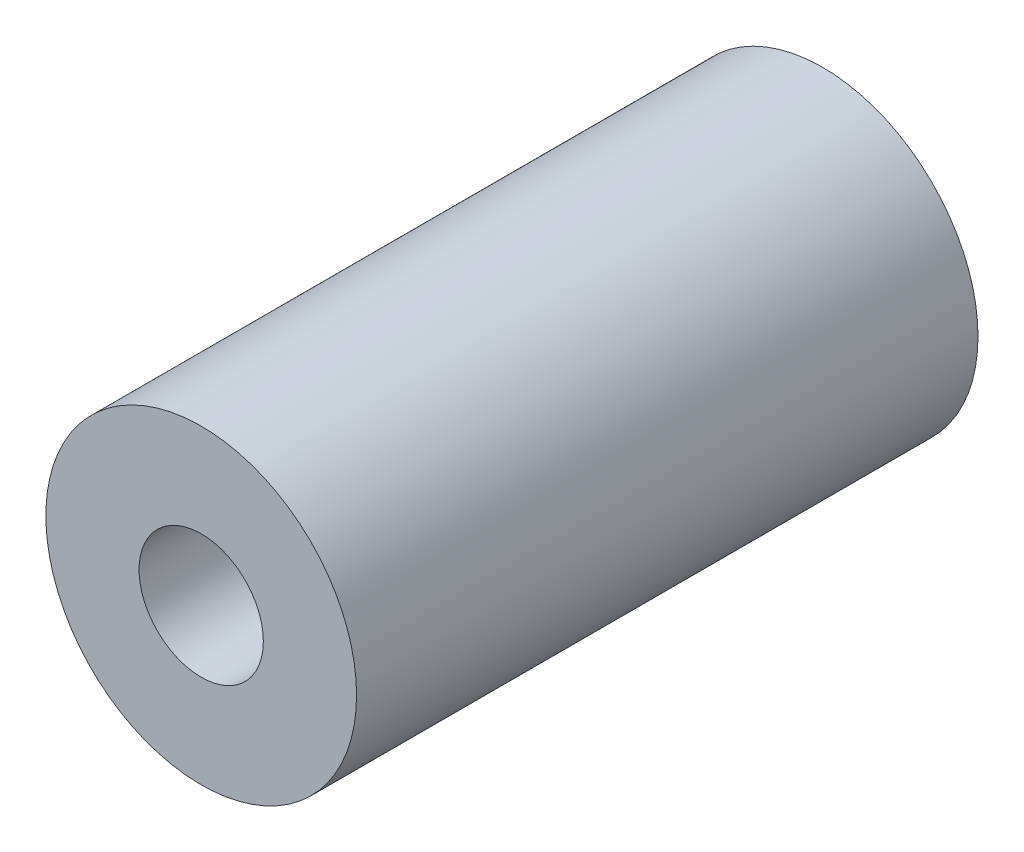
from build123d import *

# Parameters (mm, degrees)
ESQUISSE1_R             = 5
ESQUISSE1_R_2           = 2
EXTRUSION1_DEPTH        = 20
ESQUISSE6_R             = 1.5
ENL_V_MAT_EXTRU_1_DEPTH = 20


with BuildPart() as part:
    # Esquisse1 → Extrusion1 (new body)
    with BuildSketch(Plane.XY):
        Circle(ESQUISSE1_R)
        Circle(ESQUISSE1_R_2, mode=Mode.SUBTRACT)
    extrude(amount=EXTRUSION1_DEPTH)

    # Esquisse6 → Enl_v. mat.-Extru.1 (cut)
    with BuildSketch(Plane(origin=(0, 0, 0), x_dir=(-1, 0, 0), z_dir=(0, 1, 0))):
        with Locations(Location((0, 15, 0), (0, 0, 90))):
            Circle(ESQUISSE6_R)
        with Locations(Location((0, 5, 0), (0, 0, 90))):
            Circle(ESQUISSE6_R)
    extrude(amount=-ENL_V_MAT_EXTRU_1_DEPTH, mode=Mode.SUBTRACT)


solid = part.part
